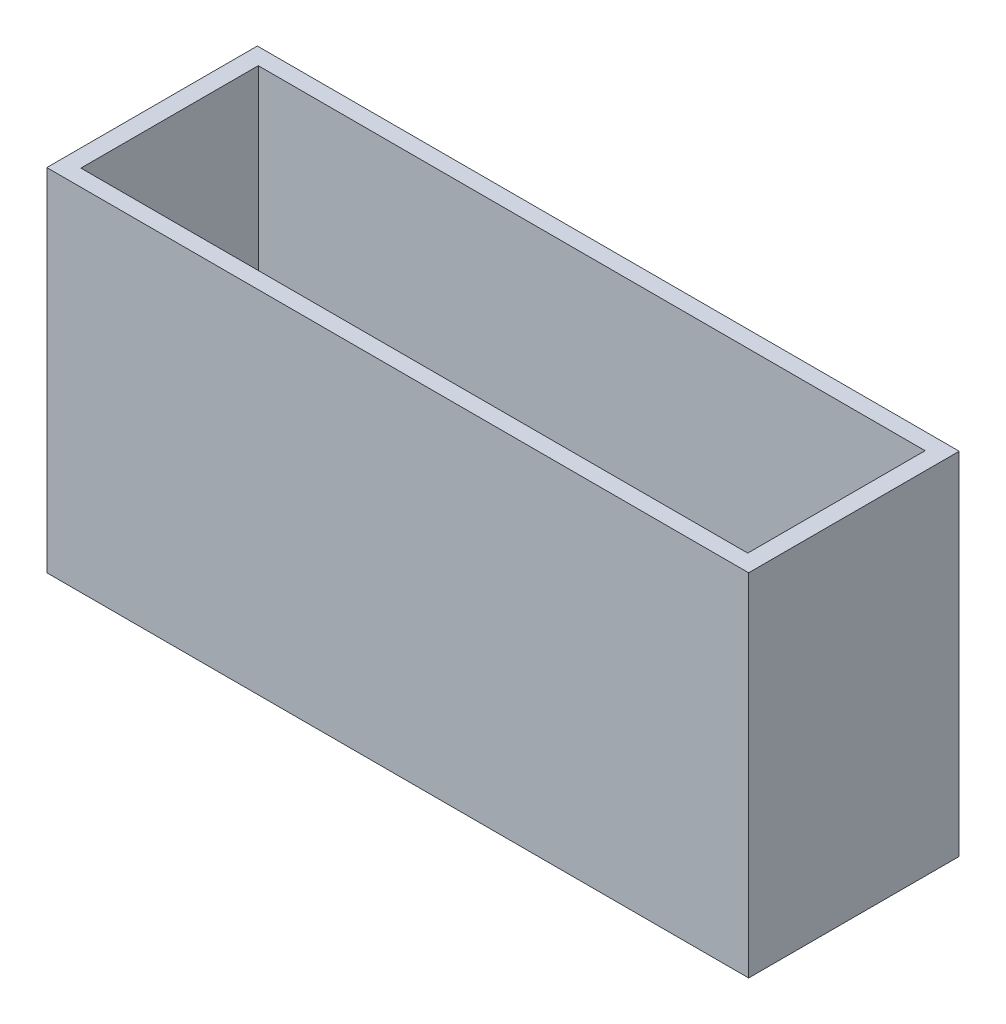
ISO-10303-21;
HEADER;
FILE_DESCRIPTION(('STEP AP214'),'2;1');
FILE_NAME('part.step','',(''),(''),'','','');
FILE_SCHEMA(('AUTOMOTIVE_DESIGN { 1 0 10303 214 1 1 1 1 }'));
ENDSEC;
DATA;
#1=APPLICATION_CONTEXT('core data for automotive mechanical design processes');
#2=APPLICATION_PROTOCOL_DEFINITION('international standard','automotive_design',2000,#1);
#3=PRODUCT_CONTEXT('',#1,'mechanical');
#4=PRODUCT('Part','Part','',(#3));
#5=PRODUCT_RELATED_PRODUCT_CATEGORY('part','',(#4));
#6=PRODUCT_DEFINITION_FORMATION('','',#4);
#7=PRODUCT_DEFINITION_CONTEXT('part definition',#1,'design');
#8=PRODUCT_DEFINITION('design','',#6,#7);
#9=PRODUCT_DEFINITION_SHAPE('','',#8);
#10=(LENGTH_UNIT() NAMED_UNIT(*) SI_UNIT(.MILLI.,.METRE.));
#11=(NAMED_UNIT(*) PLANE_ANGLE_UNIT() SI_UNIT($,.RADIAN.));
#12=(NAMED_UNIT(*) SI_UNIT($,.STERADIAN.) SOLID_ANGLE_UNIT());
#13=UNCERTAINTY_MEASURE_WITH_UNIT(LENGTH_MEASURE(1.E-05),#10,'distance_accuracy_value','');
#14=(GEOMETRIC_REPRESENTATION_CONTEXT(3) GLOBAL_UNCERTAINTY_ASSIGNED_CONTEXT((#13)) GLOBAL_UNIT_ASSIGNED_CONTEXT((#10,
#11,#12)) REPRESENTATION_CONTEXT('',''));
#15=CARTESIAN_POINT('',(0.,0.,0.));
#16=DIRECTION('',(0.,0.,1.));
#17=DIRECTION('',(1.,0.,0.));
#18=AXIS2_PLACEMENT_3D('',#15,#16,#17);
#19=CARTESIAN_POINT('',(0.,500.,0.));
#20=DIRECTION('',(0.,-1.,0.));
#21=DIRECTION('',(0.,0.,-1.));
#22=AXIS2_PLACEMENT_3D('',#19,#20,#21);
#23=PLANE('',#22);
#24=DIRECTION('',(0.,0.,1.));
#25=VECTOR('',#24,1.);
#26=CARTESIAN_POINT('',(0.,500.,0.));
#27=LINE('',#26,#25);
#28=CARTESIAN_POINT('',(0.,500.,-300.));
#29=VERTEX_POINT('',#28);
#30=CARTESIAN_POINT('',(0.,500.,0.));
#31=VERTEX_POINT('',#30);
#32=EDGE_CURVE('E138',#29,#31,#27,.T.);
#33=ORIENTED_EDGE('',*,*,#32,.T.);
#34=DIRECTION('',(1.,0.,0.));
#35=VECTOR('',#34,1.);
#36=CARTESIAN_POINT('',(0.,500.,0.));
#37=LINE('',#36,#35);
#38=CARTESIAN_POINT('',(1000.,500.,0.));
#39=VERTEX_POINT('',#38);
#40=EDGE_CURVE('E141',#31,#39,#37,.T.);
#41=ORIENTED_EDGE('',*,*,#40,.T.);
#42=DIRECTION('',(0.,0.,-1.));
#43=VECTOR('',#42,1.);
#44=CARTESIAN_POINT('',(1000.,500.,0.));
#45=LINE('',#44,#43);
#46=CARTESIAN_POINT('',(1000.,500.,-300.));
#47=VERTEX_POINT('',#46);
#48=EDGE_CURVE('E144',#39,#47,#45,.T.);
#49=ORIENTED_EDGE('',*,*,#48,.T.);
#50=DIRECTION('',(-1.,0.,0.));
#51=VECTOR('',#50,1.);
#52=CARTESIAN_POINT('',(0.,500.,-300.));
#53=LINE('',#52,#51);
#54=EDGE_CURVE('E146',#47,#29,#53,.T.);
#55=ORIENTED_EDGE('',*,*,#54,.T.);
#56=EDGE_LOOP('',(#33,#41,#49,#55));
#57=FACE_BOUND('',#56,.T.);
#58=DIRECTION('',(0.,0.,-1.));
#59=VECTOR('',#58,1.);
#60=CARTESIAN_POINT('',(975.05705249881,500.,-276.365418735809));
#61=LINE('',#60,#59);
#62=CARTESIAN_POINT('',(975.05705249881,500.,-23.6345812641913));
#63=VERTEX_POINT('',#62);
#64=CARTESIAN_POINT('',(975.05705249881,500.,-276.365418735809));
#65=VERTEX_POINT('',#64);
#66=EDGE_CURVE('E102',#63,#65,#61,.T.);
#67=ORIENTED_EDGE('',*,*,#66,.F.);
#68=DIRECTION('',(1.,0.,0.));
#69=VECTOR('',#68,1.);
#70=CARTESIAN_POINT('',(24.9429475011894,500.,-23.6345812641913));
#71=LINE('',#70,#69);
#72=CARTESIAN_POINT('',(24.9429475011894,500.,-23.6345812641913));
#73=VERTEX_POINT('',#72);
#74=EDGE_CURVE('E124',#73,#63,#71,.T.);
#75=ORIENTED_EDGE('',*,*,#74,.F.);
#76=DIRECTION('',(0.,0.,1.));
#77=VECTOR('',#76,1.);
#78=CARTESIAN_POINT('',(24.9429475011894,500.,-276.365418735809));
#79=LINE('',#78,#77);
#80=CARTESIAN_POINT('',(24.9429475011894,500.,-276.365418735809));
#81=VERTEX_POINT('',#80);
#82=EDGE_CURVE('E122',#81,#73,#79,.T.);
#83=ORIENTED_EDGE('',*,*,#82,.F.);
#84=DIRECTION('',(-1.,0.,0.));
#85=VECTOR('',#84,1.);
#86=CARTESIAN_POINT('',(24.9429475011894,500.,-276.365418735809));
#87=LINE('',#86,#85);
#88=EDGE_CURVE('E110',#65,#81,#87,.T.);
#89=ORIENTED_EDGE('',*,*,#88,.F.);
#90=EDGE_LOOP('',(#67,#75,#83,#89));
#91=FACE_BOUND('',#90,.T.);
#92=ADVANCED_FACE('F37',(#57,#91),#23,.F.);
#93=CARTESIAN_POINT('',(0.,0.,0.));
#94=DIRECTION('',(0.,-1.,0.));
#95=DIRECTION('',(0.,0.,-1.));
#96=AXIS2_PLACEMENT_3D('',#93,#94,#95);
#97=PLANE('',#96);
#98=DIRECTION('',(0.,0.,1.));
#99=VECTOR('',#98,1.);
#100=CARTESIAN_POINT('',(0.,0.,0.));
#101=LINE('',#100,#99);
#102=CARTESIAN_POINT('',(0.,0.,-300.));
#103=VERTEX_POINT('',#102);
#104=CARTESIAN_POINT('',(0.,0.,0.));
#105=VERTEX_POINT('',#104);
#106=EDGE_CURVE('E118',#103,#105,#101,.T.);
#107=ORIENTED_EDGE('',*,*,#106,.F.);
#108=DIRECTION('',(-1.,0.,0.));
#109=VECTOR('',#108,1.);
#110=CARTESIAN_POINT('',(0.,0.,-300.));
#111=LINE('',#110,#109);
#112=CARTESIAN_POINT('',(1000.,0.,-300.));
#113=VERTEX_POINT('',#112);
#114=EDGE_CURVE('E142',#113,#103,#111,.T.);
#115=ORIENTED_EDGE('',*,*,#114,.F.);
#116=DIRECTION('',(0.,0.,-1.));
#117=VECTOR('',#116,1.);
#118=CARTESIAN_POINT('',(1000.,0.,0.));
#119=LINE('',#118,#117);
#120=CARTESIAN_POINT('',(1000.,0.,0.));
#121=VERTEX_POINT('',#120);
#122=EDGE_CURVE('E153',#121,#113,#119,.T.);
#123=ORIENTED_EDGE('',*,*,#122,.F.);
#124=DIRECTION('',(1.,0.,0.));
#125=VECTOR('',#124,1.);
#126=CARTESIAN_POINT('',(0.,0.,0.));
#127=LINE('',#126,#125);
#128=EDGE_CURVE('E151',#105,#121,#127,.T.);
#129=ORIENTED_EDGE('',*,*,#128,.F.);
#130=EDGE_LOOP('',(#107,#115,#123,#129));
#131=FACE_BOUND('',#130,.T.);
#132=DIRECTION('',(1.,0.,0.));
#133=VECTOR('',#132,1.);
#134=CARTESIAN_POINT('',(24.9429475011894,0.,-23.6345812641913));
#135=LINE('',#134,#133);
#136=CARTESIAN_POINT('',(24.9429475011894,0.,-23.6345812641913));
#137=VERTEX_POINT('',#136);
#138=CARTESIAN_POINT('',(975.05705249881,0.,-23.6345812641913));
#139=VERTEX_POINT('',#138);
#140=EDGE_CURVE('E111',#137,#139,#135,.T.);
#141=ORIENTED_EDGE('',*,*,#140,.T.);
#142=DIRECTION('',(0.,0.,-1.));
#143=VECTOR('',#142,1.);
#144=CARTESIAN_POINT('',(975.05705249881,0.,-276.365418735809));
#145=LINE('',#144,#143);
#146=CARTESIAN_POINT('',(975.05705249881,0.,-276.365418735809));
#147=VERTEX_POINT('',#146);
#148=EDGE_CURVE('E60',#139,#147,#145,.T.);
#149=ORIENTED_EDGE('',*,*,#148,.T.);
#150=DIRECTION('',(-1.,0.,0.));
#151=VECTOR('',#150,1.);
#152=CARTESIAN_POINT('',(24.9429475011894,0.,-276.365418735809));
#153=LINE('',#152,#151);
#154=CARTESIAN_POINT('',(24.9429475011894,0.,-276.365418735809));
#155=VERTEX_POINT('',#154);
#156=EDGE_CURVE('E117',#147,#155,#153,.T.);
#157=ORIENTED_EDGE('',*,*,#156,.T.);
#158=DIRECTION('',(0.,0.,1.));
#159=VECTOR('',#158,1.);
#160=CARTESIAN_POINT('',(24.9429475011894,0.,-276.365418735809));
#161=LINE('',#160,#159);
#162=EDGE_CURVE('E130',#155,#137,#161,.T.);
#163=ORIENTED_EDGE('',*,*,#162,.T.);
#164=EDGE_LOOP('',(#141,#149,#157,#163));
#165=FACE_BOUND('',#164,.T.);
#166=ADVANCED_FACE('F171',(#131,#165),#97,.T.);
#167=CARTESIAN_POINT('',(0.,500.,0.));
#168=DIRECTION('',(1.,0.,0.));
#169=DIRECTION('',(0.,0.,-1.));
#170=AXIS2_PLACEMENT_3D('',#167,#168,#169);
#171=PLANE('',#170);
#172=ORIENTED_EDGE('',*,*,#106,.T.);
#173=DIRECTION('',(0.,-1.,0.));
#174=VECTOR('',#173,1.);
#175=CARTESIAN_POINT('',(0.,500.,0.));
#176=LINE('',#175,#174);
#177=EDGE_CURVE('E11',#31,#105,#176,.T.);
#178=ORIENTED_EDGE('',*,*,#177,.F.);
#179=ORIENTED_EDGE('',*,*,#32,.F.);
#180=DIRECTION('',(0.,-1.,0.));
#181=VECTOR('',#180,1.);
#182=CARTESIAN_POINT('',(0.,500.,-300.));
#183=LINE('',#182,#181);
#184=EDGE_CURVE('E148',#29,#103,#183,.T.);
#185=ORIENTED_EDGE('',*,*,#184,.T.);
#186=EDGE_LOOP('',(#172,#178,#179,#185));
#187=FACE_BOUND('',#186,.T.);
#188=ADVANCED_FACE('F39',(#187),#171,.F.);
#189=CARTESIAN_POINT('',(0.,500.,0.));
#190=DIRECTION('',(0.,0.,-1.));
#191=DIRECTION('',(-1.,0.,0.));
#192=AXIS2_PLACEMENT_3D('',#189,#190,#191);
#193=PLANE('',#192);
#194=ORIENTED_EDGE('',*,*,#128,.T.);
#195=DIRECTION('',(0.,-1.,0.));
#196=VECTOR('',#195,1.);
#197=CARTESIAN_POINT('',(1000.,500.,0.));
#198=LINE('',#197,#196);
#199=EDGE_CURVE('E45',#39,#121,#198,.T.);
#200=ORIENTED_EDGE('',*,*,#199,.F.);
#201=ORIENTED_EDGE('',*,*,#40,.F.);
#202=ORIENTED_EDGE('',*,*,#177,.T.);
#203=EDGE_LOOP('',(#194,#200,#201,#202));
#204=FACE_BOUND('',#203,.T.);
#205=ADVANCED_FACE('F181',(#204),#193,.F.);
#206=CARTESIAN_POINT('',(1000.,500.,0.));
#207=DIRECTION('',(-1.,0.,0.));
#208=DIRECTION('',(0.,0.,1.));
#209=AXIS2_PLACEMENT_3D('',#206,#207,#208);
#210=PLANE('',#209);
#211=ORIENTED_EDGE('',*,*,#122,.T.);
#212=DIRECTION('',(0.,-1.,0.));
#213=VECTOR('',#212,1.);
#214=CARTESIAN_POINT('',(1000.,500.,-300.));
#215=LINE('',#214,#213);
#216=EDGE_CURVE('E158',#47,#113,#215,.T.);
#217=ORIENTED_EDGE('',*,*,#216,.F.);
#218=ORIENTED_EDGE('',*,*,#48,.F.);
#219=ORIENTED_EDGE('',*,*,#199,.T.);
#220=EDGE_LOOP('',(#211,#217,#218,#219));
#221=FACE_BOUND('',#220,.T.);
#222=ADVANCED_FACE('F165',(#221),#210,.F.);
#223=CARTESIAN_POINT('',(0.,500.,-300.));
#224=DIRECTION('',(0.,0.,1.));
#225=DIRECTION('',(1.,0.,0.));
#226=AXIS2_PLACEMENT_3D('',#223,#224,#225);
#227=PLANE('',#226);
#228=ORIENTED_EDGE('',*,*,#114,.T.);
#229=ORIENTED_EDGE('',*,*,#184,.F.);
#230=ORIENTED_EDGE('',*,*,#54,.F.);
#231=ORIENTED_EDGE('',*,*,#216,.T.);
#232=EDGE_LOOP('',(#228,#229,#230,#231));
#233=FACE_BOUND('',#232,.T.);
#234=ADVANCED_FACE('F175',(#233),#227,.F.);
#235=CARTESIAN_POINT('',(975.05705249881,500.,-276.365418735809));
#236=DIRECTION('',(-1.,0.,0.));
#237=DIRECTION('',(0.,0.,1.));
#238=AXIS2_PLACEMENT_3D('',#235,#236,#237);
#239=PLANE('',#238);
#240=ORIENTED_EDGE('',*,*,#148,.F.);
#241=DIRECTION('',(0.,-1.,0.));
#242=VECTOR('',#241,1.);
#243=CARTESIAN_POINT('',(975.05705249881,500.,-23.6345812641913));
#244=LINE('',#243,#242);
#245=EDGE_CURVE('E106',#63,#139,#244,.T.);
#246=ORIENTED_EDGE('',*,*,#245,.F.);
#247=ORIENTED_EDGE('',*,*,#66,.T.);
#248=DIRECTION('',(0.,-1.,0.));
#249=VECTOR('',#248,1.);
#250=CARTESIAN_POINT('',(975.05705249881,500.,-276.365418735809));
#251=LINE('',#250,#249);
#252=EDGE_CURVE('E105',#65,#147,#251,.T.);
#253=ORIENTED_EDGE('',*,*,#252,.T.);
#254=EDGE_LOOP('',(#240,#246,#247,#253));
#255=FACE_BOUND('',#254,.T.);
#256=ADVANCED_FACE('F104',(#255),#239,.T.);
#257=CARTESIAN_POINT('',(24.9429475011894,500.,-276.365418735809));
#258=DIRECTION('',(0.,0.,1.));
#259=DIRECTION('',(1.,0.,0.));
#260=AXIS2_PLACEMENT_3D('',#257,#258,#259);
#261=PLANE('',#260);
#262=ORIENTED_EDGE('',*,*,#156,.F.);
#263=ORIENTED_EDGE('',*,*,#252,.F.);
#264=ORIENTED_EDGE('',*,*,#88,.T.);
#265=DIRECTION('',(0.,-1.,0.));
#266=VECTOR('',#265,1.);
#267=CARTESIAN_POINT('',(24.9429475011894,500.,-276.365418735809));
#268=LINE('',#267,#266);
#269=EDGE_CURVE('E119',#81,#155,#268,.T.);
#270=ORIENTED_EDGE('',*,*,#269,.T.);
#271=EDGE_LOOP('',(#262,#263,#264,#270));
#272=FACE_BOUND('',#271,.T.);
#273=ADVANCED_FACE('F114',(#272),#261,.T.);
#274=CARTESIAN_POINT('',(24.9429475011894,500.,-276.365418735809));
#275=DIRECTION('',(1.,0.,0.));
#276=DIRECTION('',(0.,0.,-1.));
#277=AXIS2_PLACEMENT_3D('',#274,#275,#276);
#278=PLANE('',#277);
#279=ORIENTED_EDGE('',*,*,#162,.F.);
#280=ORIENTED_EDGE('',*,*,#269,.F.);
#281=ORIENTED_EDGE('',*,*,#82,.T.);
#282=DIRECTION('',(0.,-1.,0.));
#283=VECTOR('',#282,1.);
#284=CARTESIAN_POINT('',(24.9429475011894,500.,-23.6345812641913));
#285=LINE('',#284,#283);
#286=EDGE_CURVE('E52',#73,#137,#285,.T.);
#287=ORIENTED_EDGE('',*,*,#286,.T.);
#288=EDGE_LOOP('',(#279,#280,#281,#287));
#289=FACE_BOUND('',#288,.T.);
#290=ADVANCED_FACE('F204',(#289),#278,.T.);
#291=CARTESIAN_POINT('',(24.9429475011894,500.,-23.6345812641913));
#292=DIRECTION('',(0.,0.,-1.));
#293=DIRECTION('',(-1.,0.,0.));
#294=AXIS2_PLACEMENT_3D('',#291,#292,#293);
#295=PLANE('',#294);
#296=ORIENTED_EDGE('',*,*,#140,.F.);
#297=ORIENTED_EDGE('',*,*,#286,.F.);
#298=ORIENTED_EDGE('',*,*,#74,.T.);
#299=ORIENTED_EDGE('',*,*,#245,.T.);
#300=EDGE_LOOP('',(#296,#297,#298,#299));
#301=FACE_BOUND('',#300,.T.);
#302=ADVANCED_FACE('F208',(#301),#295,.T.);
#303=CLOSED_SHELL('',(#92,#166,#188,#205,#222,#234,#256,#273,#290,#302));
#304=MANIFOLD_SOLID_BREP('B2',#303);
#305=ADVANCED_BREP_SHAPE_REPRESENTATION('',(#18,#304),#14);
#306=SHAPE_DEFINITION_REPRESENTATION(#9,#305);
ENDSEC;
END-ISO-10303-21;
